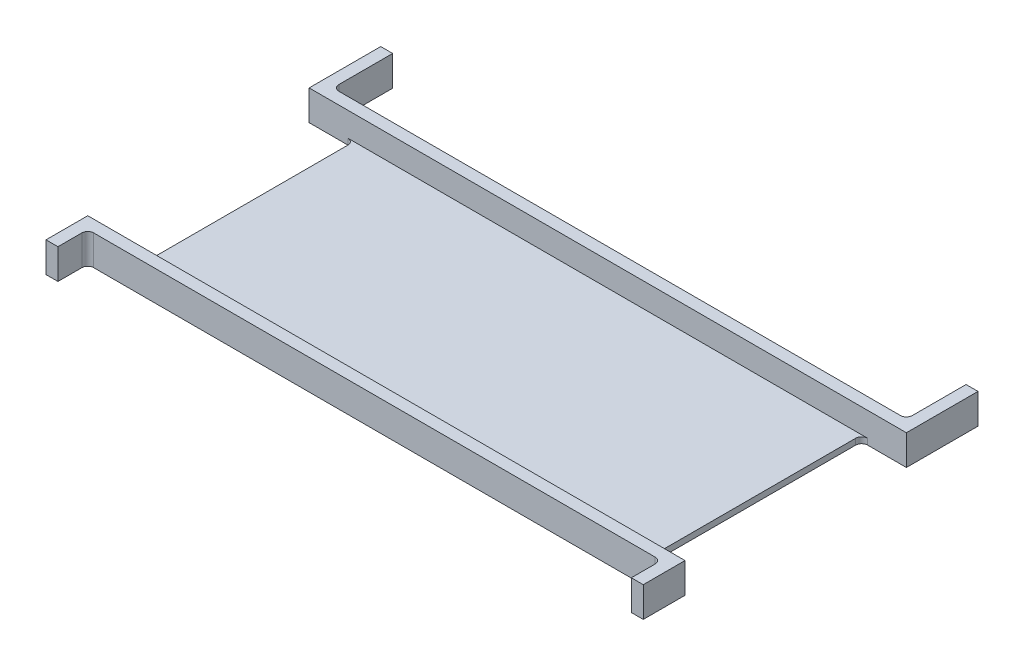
from build123d import *

# Parameters (mm, degrees)
BOSS_EXTRUDE1_DEPTH = 1
BOSS_EXTRUDE2_DEPTH = 5.05


with BuildPart() as part:
    # Sketch1 → Boss-Extrude1 (new body)
    with BuildSketch(Plane(origin=(0, 0, 0), x_dir=(1, 0, 0), z_dir=(0, 1, 0))):
        with BuildLine():
            Line((92.6, 8), (92.6, 43.1))
            ThreePointArc((92.6, 43.1), (92.892893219, 43.807106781), (93.6, 44.1))
            Line((93.6, 44.1), (6.5, 44.1))
            ThreePointArc((6.5, 44.1), (7.207106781, 43.807106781), (7.5, 43.1))
            Line((7.5, 43.1), (7.5, 8))
            ThreePointArc((7.5, 8), (7.207106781, 7.292893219), (6.5, 7))
            Line((6.5, 7), (93.6, 7))
            ThreePointArc((93.6, 7), (92.892893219, 7.292893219), (92.6, 8))
        make_face()
    extrude(amount=BOSS_EXTRUDE1_DEPTH)

    # Sketch1_3 → Boss-Extrude2 (add)
    with BuildSketch(Plane(origin=(0, 0, 0), x_dir=(1, 0, 0), z_dir=(0, 1, 0))):
        with BuildLine():
            Line((97.1, 46.1), (3, 46.1))
            ThreePointArc((3, 46.1), (2.292893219, 46.392893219), (2, 47.1))
            Line((2, 47.1), (2, 56.1))
            Line((2, 56.1), (0, 56.1))
            Line((0, 56.1), (0, 44.1))
            Line((0, 44.1), (6.5, 44.1))
            Line((6.5, 44.1), (93.6, 44.1))
            Line((93.6, 44.1), (100.1, 44.1))
            Line((100.1, 44.1), (100.1, 56.1))
            Line((100.1, 56.1), (98.1, 56.1))
            Line((98.1, 56.1), (98.1, 47.1))
            ThreePointArc((98.1, 47.1), (97.807106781, 46.392893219), (97.1, 46.1))
        make_face()
        with BuildLine():
            ThreePointArc((98.1, 4), (97.807106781, 4.707106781), (97.1, 5))
            Line((97.1, 5), (3, 5))
            ThreePointArc((3, 5), (2.292893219, 4.707106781), (2, 4))
            Line((2, 4), (2, 0))
            Line((2, 0), (0, 0))
            Line((0, 0), (0, 7))
            Line((0, 7), (6.5, 7))
            Line((6.5, 7), (93.6, 7))
            Line((93.6, 7), (100.1, 7))
            Line((100.1, 7), (100.1, 0))
            Line((100.1, 0), (98.1, 0))
            Line((98.1, 0), (98.1, 4))
        make_face()
    extrude(amount=BOSS_EXTRUDE2_DEPTH)


solid = part.part
